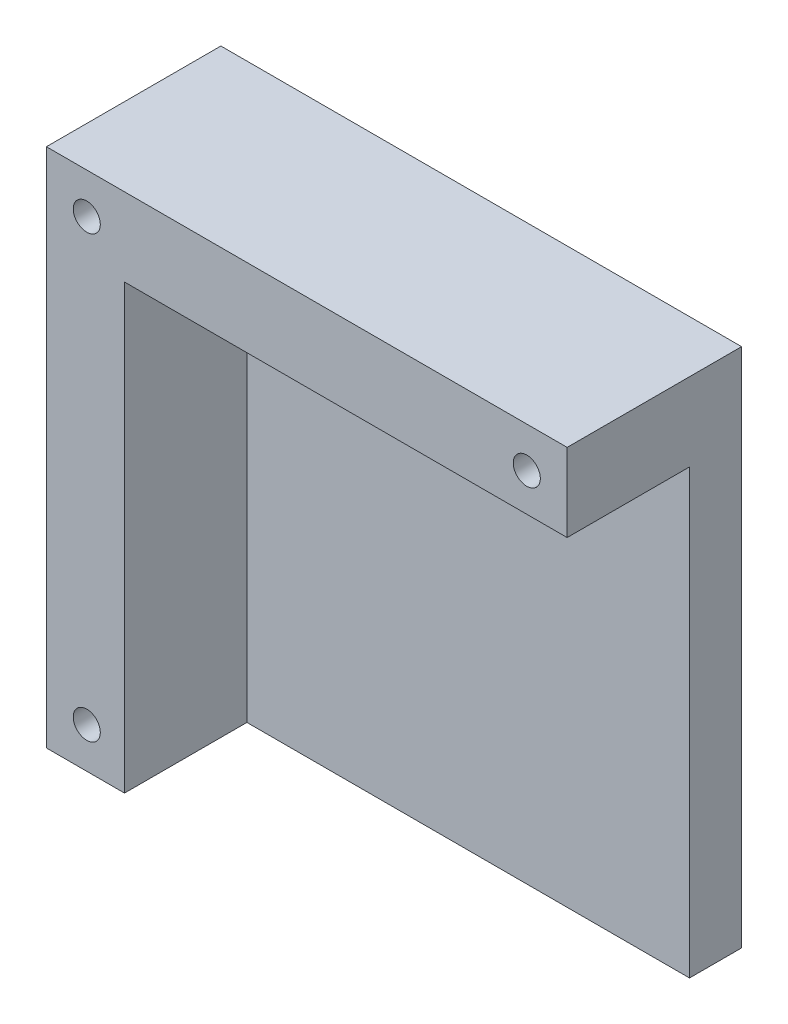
ISO-10303-21;
HEADER;
FILE_DESCRIPTION(('STEP AP214'),'2;1');
FILE_NAME('part.step','',(''),(''),'','','');
FILE_SCHEMA(('AUTOMOTIVE_DESIGN { 1 0 10303 214 1 1 1 1 }'));
ENDSEC;
DATA;
#1=APPLICATION_CONTEXT('core data for automotive mechanical design processes');
#2=APPLICATION_PROTOCOL_DEFINITION('international standard','automotive_design',2000,#1);
#3=PRODUCT_CONTEXT('',#1,'mechanical');
#4=PRODUCT('Part','Part','',(#3));
#5=PRODUCT_RELATED_PRODUCT_CATEGORY('part','',(#4));
#6=PRODUCT_DEFINITION_FORMATION('','',#4);
#7=PRODUCT_DEFINITION_CONTEXT('part definition',#1,'design');
#8=PRODUCT_DEFINITION('design','',#6,#7);
#9=PRODUCT_DEFINITION_SHAPE('','',#8);
#10=(LENGTH_UNIT() NAMED_UNIT(*) SI_UNIT(.MILLI.,.METRE.));
#11=(NAMED_UNIT(*) PLANE_ANGLE_UNIT() SI_UNIT($,.RADIAN.));
#12=(NAMED_UNIT(*) SI_UNIT($,.STERADIAN.) SOLID_ANGLE_UNIT());
#13=UNCERTAINTY_MEASURE_WITH_UNIT(LENGTH_MEASURE(1.E-05),#10,'distance_accuracy_value','');
#14=(GEOMETRIC_REPRESENTATION_CONTEXT(3) GLOBAL_UNCERTAINTY_ASSIGNED_CONTEXT((#13)) GLOBAL_UNIT_ASSIGNED_CONTEXT((#10,
#11,#12)) REPRESENTATION_CONTEXT('',''));
#15=CARTESIAN_POINT('',(0.,0.,0.));
#16=DIRECTION('',(0.,0.,1.));
#17=DIRECTION('',(1.,0.,0.));
#18=AXIS2_PLACEMENT_3D('',#15,#16,#17);
#19=CARTESIAN_POINT('',(-59.9893392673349,29.8525148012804,33.5));
#20=DIRECTION('',(1.,0.,0.));
#21=DIRECTION('',(0.,1.,0.));
#22=AXIS2_PLACEMENT_3D('',#19,#20,#21);
#23=PLANE('',#22);
#24=DIRECTION('',(0.,-1.,0.));
#25=VECTOR('',#24,1.);
#26=CARTESIAN_POINT('',(-59.9893392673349,29.8525148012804,0.));
#27=LINE('',#26,#25);
#28=CARTESIAN_POINT('',(-59.9893392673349,29.8525148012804,0.));
#29=VERTEX_POINT('',#28);
#30=CARTESIAN_POINT('',(-59.9893392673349,-70.1474851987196,0.));
#31=VERTEX_POINT('',#30);
#32=EDGE_CURVE('E133',#29,#31,#27,.T.);
#33=ORIENTED_EDGE('',*,*,#32,.T.);
#34=DIRECTION('',(0.,0.,-1.));
#35=VECTOR('',#34,1.);
#36=CARTESIAN_POINT('',(-59.9893392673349,-70.1474851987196,33.5));
#37=LINE('',#36,#35);
#38=CARTESIAN_POINT('',(-59.9893392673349,-70.1474851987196,33.5));
#39=VERTEX_POINT('',#38);
#40=EDGE_CURVE('E11',#39,#31,#37,.T.);
#41=ORIENTED_EDGE('',*,*,#40,.F.);
#42=DIRECTION('',(0.,-1.,0.));
#43=VECTOR('',#42,1.);
#44=CARTESIAN_POINT('',(-59.9893392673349,29.8525148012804,33.5));
#45=LINE('',#44,#43);
#46=CARTESIAN_POINT('',(-59.9893392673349,29.8525148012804,33.5));
#47=VERTEX_POINT('',#46);
#48=EDGE_CURVE('E127',#47,#39,#45,.T.);
#49=ORIENTED_EDGE('',*,*,#48,.F.);
#50=DIRECTION('',(0.,0.,-1.));
#51=VECTOR('',#50,1.);
#52=CARTESIAN_POINT('',(-59.9893392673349,29.8525148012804,33.5));
#53=LINE('',#52,#51);
#54=EDGE_CURVE('E132',#47,#29,#53,.T.);
#55=ORIENTED_EDGE('',*,*,#54,.T.);
#56=EDGE_LOOP('',(#33,#41,#49,#55));
#57=FACE_BOUND('',#56,.T.);
#58=ADVANCED_FACE('F32',(#57),#23,.F.);
#59=CARTESIAN_POINT('',(-59.9893392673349,-70.1474851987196,33.5));
#60=DIRECTION('',(0.,1.,0.));
#61=DIRECTION('',(0.,0.,1.));
#62=AXIS2_PLACEMENT_3D('',#59,#60,#61);
#63=PLANE('',#62);
#64=DIRECTION('',(1.,0.,0.));
#65=VECTOR('',#64,1.);
#66=CARTESIAN_POINT('',(40.0106607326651,-70.1474851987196,10.));
#67=LINE('',#66,#65);
#68=CARTESIAN_POINT('',(-44.9893392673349,-70.1474851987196,10.));
#69=VERTEX_POINT('',#68);
#70=CARTESIAN_POINT('',(40.0106607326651,-70.1474851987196,10.));
#71=VERTEX_POINT('',#70);
#72=EDGE_CURVE('E112',#69,#71,#67,.T.);
#73=ORIENTED_EDGE('',*,*,#72,.F.);
#74=DIRECTION('',(0.,0.,1.));
#75=VECTOR('',#74,1.);
#76=CARTESIAN_POINT('',(-44.9893392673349,-70.1474851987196,10.));
#77=LINE('',#76,#75);
#78=CARTESIAN_POINT('',(-44.9893392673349,-70.1474851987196,33.5));
#79=VERTEX_POINT('',#78);
#80=EDGE_CURVE('E122',#69,#79,#77,.T.);
#81=ORIENTED_EDGE('',*,*,#80,.T.);
#82=DIRECTION('',(1.,0.,0.));
#83=VECTOR('',#82,1.);
#84=CARTESIAN_POINT('',(-59.9893392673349,-70.1474851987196,33.5));
#85=LINE('',#84,#83);
#86=EDGE_CURVE('E81',#39,#79,#85,.T.);
#87=ORIENTED_EDGE('',*,*,#86,.F.);
#88=ORIENTED_EDGE('',*,*,#40,.T.);
#89=DIRECTION('',(1.,0.,0.));
#90=VECTOR('',#89,1.);
#91=CARTESIAN_POINT('',(-59.9893392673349,-70.1474851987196,0.));
#92=LINE('',#91,#90);
#93=CARTESIAN_POINT('',(40.0106607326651,-70.1474851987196,0.));
#94=VERTEX_POINT('',#93);
#95=EDGE_CURVE('E136',#31,#94,#92,.T.);
#96=ORIENTED_EDGE('',*,*,#95,.T.);
#97=DIRECTION('',(0.,0.,-1.));
#98=VECTOR('',#97,1.);
#99=CARTESIAN_POINT('',(40.0106607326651,-70.1474851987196,33.5));
#100=LINE('',#99,#98);
#101=EDGE_CURVE('E39',#71,#94,#100,.T.);
#102=ORIENTED_EDGE('',*,*,#101,.F.);
#103=EDGE_LOOP('',(#73,#81,#87,#88,#96,#102));
#104=FACE_BOUND('',#103,.T.);
#105=ADVANCED_FACE('F145',(#104),#63,.F.);
#106=CARTESIAN_POINT('',(40.0106607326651,29.8525148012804,33.5));
#107=DIRECTION('',(-1.,0.,0.));
#108=DIRECTION('',(0.,-1.,0.));
#109=AXIS2_PLACEMENT_3D('',#106,#107,#108);
#110=PLANE('',#109);
#111=DIRECTION('',(0.,1.,0.));
#112=VECTOR('',#111,1.);
#113=CARTESIAN_POINT('',(40.0106607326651,29.8525148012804,33.5));
#114=LINE('',#113,#112);
#115=CARTESIAN_POINT('',(40.0106607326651,14.8525148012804,33.5));
#116=VERTEX_POINT('',#115);
#117=CARTESIAN_POINT('',(40.0106607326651,29.8525148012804,33.5));
#118=VERTEX_POINT('',#117);
#119=EDGE_CURVE('E120',#116,#118,#114,.T.);
#120=ORIENTED_EDGE('',*,*,#119,.F.);
#121=DIRECTION('',(0.,0.,1.));
#122=VECTOR('',#121,1.);
#123=CARTESIAN_POINT('',(40.0106607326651,14.8525148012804,10.));
#124=LINE('',#123,#122);
#125=CARTESIAN_POINT('',(40.0106607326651,14.8525148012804,10.));
#126=VERTEX_POINT('',#125);
#127=EDGE_CURVE('E46',#126,#116,#124,.T.);
#128=ORIENTED_EDGE('',*,*,#127,.F.);
#129=DIRECTION('',(0.,1.,0.));
#130=VECTOR('',#129,1.);
#131=CARTESIAN_POINT('',(40.0106607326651,-70.1474851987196,10.));
#132=LINE('',#131,#130);
#133=EDGE_CURVE('E107',#71,#126,#132,.T.);
#134=ORIENTED_EDGE('',*,*,#133,.F.);
#135=ORIENTED_EDGE('',*,*,#101,.T.);
#136=DIRECTION('',(0.,1.,0.));
#137=VECTOR('',#136,1.);
#138=CARTESIAN_POINT('',(40.0106607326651,29.8525148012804,0.));
#139=LINE('',#138,#137);
#140=CARTESIAN_POINT('',(40.0106607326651,29.8525148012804,0.));
#141=VERTEX_POINT('',#140);
#142=EDGE_CURVE('E139',#94,#141,#139,.T.);
#143=ORIENTED_EDGE('',*,*,#142,.T.);
#144=DIRECTION('',(0.,0.,-1.));
#145=VECTOR('',#144,1.);
#146=CARTESIAN_POINT('',(40.0106607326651,29.8525148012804,33.5));
#147=LINE('',#146,#145);
#148=EDGE_CURVE('E143',#118,#141,#147,.T.);
#149=ORIENTED_EDGE('',*,*,#148,.F.);
#150=EDGE_LOOP('',(#120,#128,#134,#135,#143,#149));
#151=FACE_BOUND('',#150,.T.);
#152=ADVANCED_FACE('F118',(#151),#110,.F.);
#153=CARTESIAN_POINT('',(-59.9893392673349,29.8525148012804,33.5));
#154=DIRECTION('',(0.,-1.,0.));
#155=DIRECTION('',(0.,0.,-1.));
#156=AXIS2_PLACEMENT_3D('',#153,#154,#155);
#157=PLANE('',#156);
#158=DIRECTION('',(-1.,0.,0.));
#159=VECTOR('',#158,1.);
#160=CARTESIAN_POINT('',(-59.9893392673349,29.8525148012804,0.));
#161=LINE('',#160,#159);
#162=EDGE_CURVE('E75',#141,#29,#161,.T.);
#163=ORIENTED_EDGE('',*,*,#162,.T.);
#164=ORIENTED_EDGE('',*,*,#54,.F.);
#165=DIRECTION('',(-1.,0.,0.));
#166=VECTOR('',#165,1.);
#167=CARTESIAN_POINT('',(-59.9893392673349,29.8525148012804,33.5));
#168=LINE('',#167,#166);
#169=EDGE_CURVE('E55',#118,#47,#168,.T.);
#170=ORIENTED_EDGE('',*,*,#169,.F.);
#171=ORIENTED_EDGE('',*,*,#148,.T.);
#172=EDGE_LOOP('',(#163,#164,#170,#171));
#173=FACE_BOUND('',#172,.T.);
#174=ADVANCED_FACE('F152',(#173),#157,.F.);
#175=CARTESIAN_POINT('',(0.,0.,33.5));
#176=DIRECTION('',(0.,0.,1.));
#177=DIRECTION('',(1.,0.,0.));
#178=AXIS2_PLACEMENT_3D('',#175,#176,#177);
#179=PLANE('',#178);
#180=CARTESIAN_POINT('',(32.2606607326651,22.1025148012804,33.5));
#181=DIRECTION('',(0.,0.,1.));
#182=DIRECTION('',(1.,0.,0.));
#183=AXIS2_PLACEMENT_3D('',#180,#181,#182);
#184=CIRCLE('',#183,2.6);
#185=CARTESIAN_POINT('',(34.8606607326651,22.1025148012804,33.5));
#186=VERTEX_POINT('',#185);
#187=EDGE_CURVE('E252',#186,#186,#184,.F.);
#188=ORIENTED_EDGE('',*,*,#187,.T.);
#189=EDGE_LOOP('',(#188));
#190=FACE_BOUND('',#189,.T.);
#191=CARTESIAN_POINT('',(-52.2393392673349,-62.3974851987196,33.5));
#192=DIRECTION('',(0.,0.,1.));
#193=DIRECTION('',(1.,0.,0.));
#194=AXIS2_PLACEMENT_3D('',#191,#192,#193);
#195=CIRCLE('',#194,2.6);
#196=CARTESIAN_POINT('',(-49.6393392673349,-62.3974851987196,33.5));
#197=VERTEX_POINT('',#196);
#198=EDGE_CURVE('E260',#197,#197,#195,.F.);
#199=ORIENTED_EDGE('',*,*,#198,.T.);
#200=EDGE_LOOP('',(#199));
#201=FACE_BOUND('',#200,.T.);
#202=CARTESIAN_POINT('',(-52.2393392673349,22.1025148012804,33.5));
#203=DIRECTION('',(0.,0.,1.));
#204=DIRECTION('',(1.,0.,0.));
#205=AXIS2_PLACEMENT_3D('',#202,#203,#204);
#206=CIRCLE('',#205,2.6);
#207=CARTESIAN_POINT('',(-49.6393392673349,22.1025148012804,33.5));
#208=VERTEX_POINT('',#207);
#209=EDGE_CURVE('E256',#208,#208,#206,.F.);
#210=ORIENTED_EDGE('',*,*,#209,.T.);
#211=EDGE_LOOP('',(#210));
#212=FACE_BOUND('',#211,.T.);
#213=DIRECTION('',(0.,-1.,0.));
#214=VECTOR('',#213,1.);
#215=CARTESIAN_POINT('',(-44.9893392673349,-70.1474851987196,33.5));
#216=LINE('',#215,#214);
#217=CARTESIAN_POINT('',(-44.9893392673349,14.8525148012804,33.5));
#218=VERTEX_POINT('',#217);
#219=EDGE_CURVE('E115',#218,#79,#216,.T.);
#220=ORIENTED_EDGE('',*,*,#219,.F.);
#221=DIRECTION('',(-1.,0.,0.));
#222=VECTOR('',#221,1.);
#223=CARTESIAN_POINT('',(40.0106607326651,14.8525148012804,33.5));
#224=LINE('',#223,#222);
#225=EDGE_CURVE('E270',#116,#218,#224,.T.);
#226=ORIENTED_EDGE('',*,*,#225,.F.);
#227=ORIENTED_EDGE('',*,*,#119,.T.);
#228=ORIENTED_EDGE('',*,*,#169,.T.);
#229=ORIENTED_EDGE('',*,*,#48,.T.);
#230=ORIENTED_EDGE('',*,*,#86,.T.);
#231=EDGE_LOOP('',(#220,#226,#227,#228,#229,#230));
#232=FACE_BOUND('',#231,.T.);
#233=ADVANCED_FACE('F154',(#190,#201,#212,#232),#179,.T.);
#234=CARTESIAN_POINT('',(0.,0.,0.));
#235=DIRECTION('',(0.,0.,1.));
#236=DIRECTION('',(1.,0.,0.));
#237=AXIS2_PLACEMENT_3D('',#234,#235,#236);
#238=PLANE('',#237);
#239=CARTESIAN_POINT('',(32.2606607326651,22.1025148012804,0.));
#240=DIRECTION('',(0.,0.,1.));
#241=DIRECTION('',(1.,0.,0.));
#242=AXIS2_PLACEMENT_3D('',#239,#240,#241);
#243=CIRCLE('',#242,2.6);
#244=CARTESIAN_POINT('',(34.8606607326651,22.1025148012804,0.));
#245=VERTEX_POINT('',#244);
#246=EDGE_CURVE('E255',#245,#245,#243,.T.);
#247=ORIENTED_EDGE('',*,*,#246,.T.);
#248=EDGE_LOOP('',(#247));
#249=FACE_BOUND('',#248,.T.);
#250=CARTESIAN_POINT('',(-52.2393392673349,-62.3974851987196,0.));
#251=DIRECTION('',(0.,0.,1.));
#252=DIRECTION('',(1.,0.,0.));
#253=AXIS2_PLACEMENT_3D('',#250,#251,#252);
#254=CIRCLE('',#253,2.6);
#255=CARTESIAN_POINT('',(-49.6393392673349,-62.3974851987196,0.));
#256=VERTEX_POINT('',#255);
#257=EDGE_CURVE('E257',#256,#256,#254,.T.);
#258=ORIENTED_EDGE('',*,*,#257,.T.);
#259=EDGE_LOOP('',(#258));
#260=FACE_BOUND('',#259,.T.);
#261=CARTESIAN_POINT('',(-52.2393392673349,22.1025148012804,0.));
#262=DIRECTION('',(0.,0.,1.));
#263=DIRECTION('',(1.,0.,0.));
#264=AXIS2_PLACEMENT_3D('',#261,#262,#263);
#265=CIRCLE('',#264,2.6);
#266=CARTESIAN_POINT('',(-49.6393392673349,22.1025148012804,0.));
#267=VERTEX_POINT('',#266);
#268=EDGE_CURVE('E263',#267,#267,#265,.T.);
#269=ORIENTED_EDGE('',*,*,#268,.T.);
#270=EDGE_LOOP('',(#269));
#271=FACE_BOUND('',#270,.T.);
#272=ORIENTED_EDGE('',*,*,#32,.F.);
#273=ORIENTED_EDGE('',*,*,#162,.F.);
#274=ORIENTED_EDGE('',*,*,#142,.F.);
#275=ORIENTED_EDGE('',*,*,#95,.F.);
#276=EDGE_LOOP('',(#272,#273,#274,#275));
#277=FACE_BOUND('',#276,.T.);
#278=ADVANCED_FACE('F149',(#249,#260,#271,#277),#238,.F.);
#279=CARTESIAN_POINT('',(-44.9893392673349,-70.1474851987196,10.));
#280=DIRECTION('',(-1.,0.,0.));
#281=DIRECTION('',(0.,0.,1.));
#282=AXIS2_PLACEMENT_3D('',#279,#280,#281);
#283=PLANE('',#282);
#284=ORIENTED_EDGE('',*,*,#219,.T.);
#285=ORIENTED_EDGE('',*,*,#80,.F.);
#286=DIRECTION('',(0.,-1.,0.));
#287=VECTOR('',#286,1.);
#288=CARTESIAN_POINT('',(-44.9893392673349,-70.1474851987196,10.));
#289=LINE('',#288,#287);
#290=CARTESIAN_POINT('',(-44.9893392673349,14.8525148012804,10.));
#291=VERTEX_POINT('',#290);
#292=EDGE_CURVE('E106',#291,#69,#289,.T.);
#293=ORIENTED_EDGE('',*,*,#292,.F.);
#294=DIRECTION('',(0.,0.,1.));
#295=VECTOR('',#294,1.);
#296=CARTESIAN_POINT('',(-44.9893392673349,14.8525148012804,10.));
#297=LINE('',#296,#295);
#298=EDGE_CURVE('E102',#291,#218,#297,.T.);
#299=ORIENTED_EDGE('',*,*,#298,.T.);
#300=EDGE_LOOP('',(#284,#285,#293,#299));
#301=FACE_BOUND('',#300,.T.);
#302=ADVANCED_FACE('F180',(#301),#283,.F.);
#303=CARTESIAN_POINT('',(40.0106607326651,14.8525148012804,10.));
#304=DIRECTION('',(0.,1.,0.));
#305=DIRECTION('',(-1.,0.,0.));
#306=AXIS2_PLACEMENT_3D('',#303,#304,#305);
#307=PLANE('',#306);
#308=ORIENTED_EDGE('',*,*,#225,.T.);
#309=ORIENTED_EDGE('',*,*,#298,.F.);
#310=DIRECTION('',(-1.,0.,0.));
#311=VECTOR('',#310,1.);
#312=CARTESIAN_POINT('',(40.0106607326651,14.8525148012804,10.));
#313=LINE('',#312,#311);
#314=EDGE_CURVE('E99',#126,#291,#313,.T.);
#315=ORIENTED_EDGE('',*,*,#314,.F.);
#316=ORIENTED_EDGE('',*,*,#127,.T.);
#317=EDGE_LOOP('',(#308,#309,#315,#316));
#318=FACE_BOUND('',#317,.T.);
#319=ADVANCED_FACE('F101',(#318),#307,.F.);
#320=CARTESIAN_POINT('',(0.,0.,10.));
#321=DIRECTION('',(0.,0.,1.));
#322=DIRECTION('',(1.,0.,0.));
#323=AXIS2_PLACEMENT_3D('',#320,#321,#322);
#324=PLANE('',#323);
#325=ORIENTED_EDGE('',*,*,#133,.T.);
#326=ORIENTED_EDGE('',*,*,#314,.T.);
#327=ORIENTED_EDGE('',*,*,#292,.T.);
#328=ORIENTED_EDGE('',*,*,#72,.T.);
#329=EDGE_LOOP('',(#325,#326,#327,#328));
#330=FACE_BOUND('',#329,.T.);
#331=ADVANCED_FACE('F110',(#330),#324,.T.);
#332=CARTESIAN_POINT('',(-52.2393392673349,22.1025148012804,40.));
#333=DIRECTION('',(0.,0.,-1.));
#334=DIRECTION('',(-1.,0.,0.));
#335=AXIS2_PLACEMENT_3D('',#332,#333,#334);
#336=CYLINDRICAL_SURFACE('',#335,2.6);
#337=ORIENTED_EDGE('',*,*,#209,.F.);
#338=EDGE_LOOP('',(#337));
#339=FACE_BOUND('',#338,.T.);
#340=ORIENTED_EDGE('',*,*,#268,.F.);
#341=EDGE_LOOP('',(#340));
#342=FACE_BOUND('',#341,.T.);
#343=ADVANCED_FACE('F204',(#339,#342),#336,.F.);
#344=CARTESIAN_POINT('',(-52.2393392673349,-62.3974851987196,40.));
#345=DIRECTION('',(0.,0.,-1.));
#346=DIRECTION('',(-1.,0.,0.));
#347=AXIS2_PLACEMENT_3D('',#344,#345,#346);
#348=CYLINDRICAL_SURFACE('',#347,2.6);
#349=ORIENTED_EDGE('',*,*,#198,.F.);
#350=EDGE_LOOP('',(#349));
#351=FACE_BOUND('',#350,.T.);
#352=ORIENTED_EDGE('',*,*,#257,.F.);
#353=EDGE_LOOP('',(#352));
#354=FACE_BOUND('',#353,.T.);
#355=ADVANCED_FACE('F225',(#351,#354),#348,.F.);
#356=CARTESIAN_POINT('',(32.2606607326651,22.1025148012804,40.));
#357=DIRECTION('',(0.,0.,-1.));
#358=DIRECTION('',(-1.,0.,0.));
#359=AXIS2_PLACEMENT_3D('',#356,#357,#358);
#360=CYLINDRICAL_SURFACE('',#359,2.6);
#361=ORIENTED_EDGE('',*,*,#187,.F.);
#362=EDGE_LOOP('',(#361));
#363=FACE_BOUND('',#362,.T.);
#364=ORIENTED_EDGE('',*,*,#246,.F.);
#365=EDGE_LOOP('',(#364));
#366=FACE_BOUND('',#365,.T.);
#367=ADVANCED_FACE('F235',(#363,#366),#360,.F.);
#368=CLOSED_SHELL('',(#58,#105,#152,#174,#233,#278,#302,#319,#331,#343,#355,#367));
#369=MANIFOLD_SOLID_BREP('B2',#368);
#370=ADVANCED_BREP_SHAPE_REPRESENTATION('',(#18,#369),#14);
#371=SHAPE_DEFINITION_REPRESENTATION(#9,#370);
ENDSEC;
END-ISO-10303-21;
